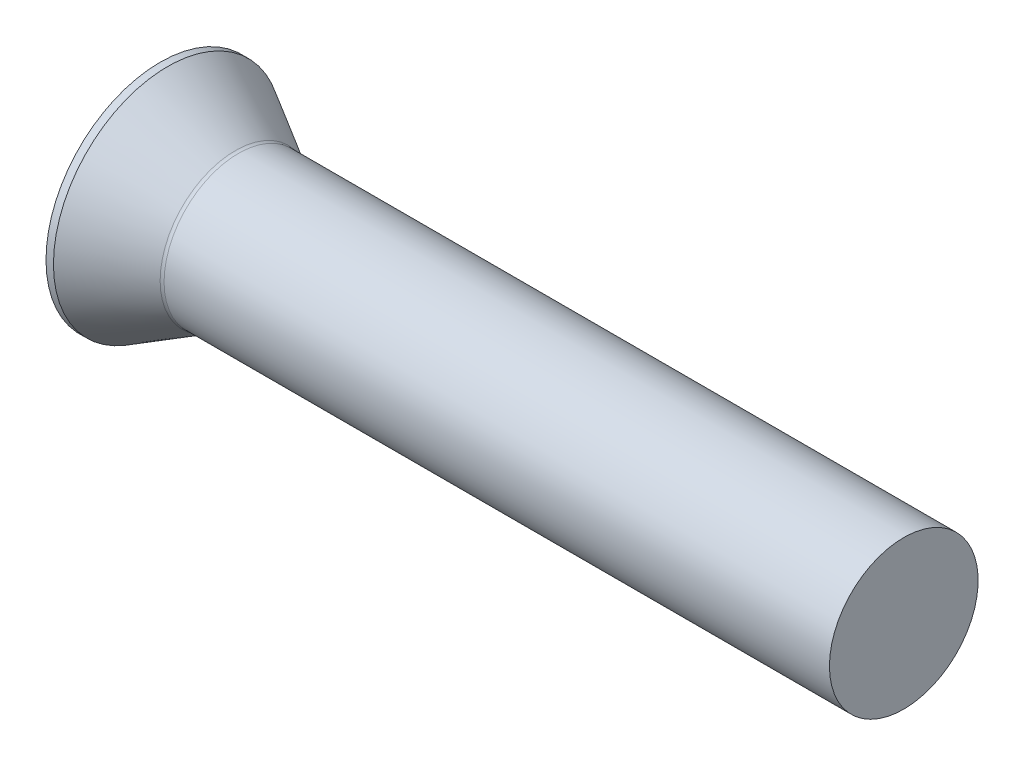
from build123d import *


with BuildPart() as part:
    # Sketch1 → Base-Revolve (revolve)
    with BuildSketch(Plane.XY, mode=Mode.PRIVATE) as base_revolve_sk:
        with BuildLine():
            Line((62.62501402, 0), (62.62501402, 6))
            Line((62.62501402, 6), (8.933974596, 6))
            ThreePointArc((8.933974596, 6), (8.804565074, 6.017037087), (8.683974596, 6.066987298))
            Line((8.683974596, 6.066987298), (3.22501402, 9.218719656))
            Line((3.22501402, 9.218719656), (2.62501402, 9.218719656))
            ThreePointArc((2.62501402, 9.218719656), (0.66904259, 4.792585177), (0, 0))
            Line((0, 0), (62.62501402, 0))
        make_face()
    revolve(base_revolve_sk.sketch.rotate(Axis((-34.729888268, 0, 0), (1, 0, 0)), 90), axis=Axis((-34.729888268, 0, 0), (1, 0, 0)))


solid = part.part
